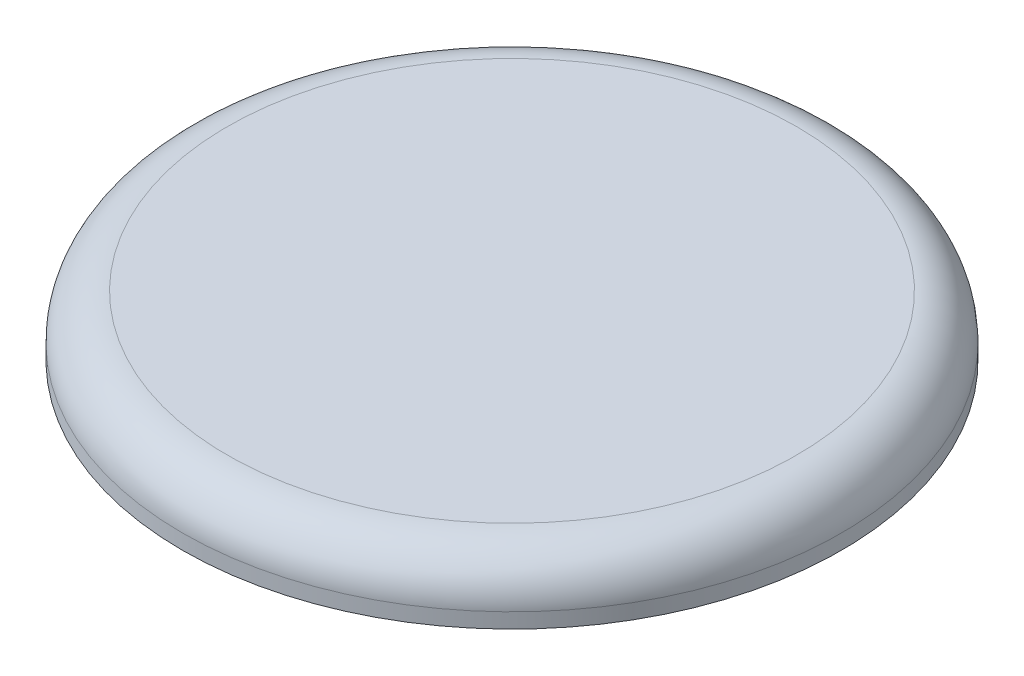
ISO-10303-21;
HEADER;
FILE_DESCRIPTION(('STEP AP214'),'2;1');
FILE_NAME('part.step','',(''),(''),'','','');
FILE_SCHEMA(('AUTOMOTIVE_DESIGN { 1 0 10303 214 1 1 1 1 }'));
ENDSEC;
DATA;
#1=APPLICATION_CONTEXT('core data for automotive mechanical design processes');
#2=APPLICATION_PROTOCOL_DEFINITION('international standard','automotive_design',2000,#1);
#3=PRODUCT_CONTEXT('',#1,'mechanical');
#4=PRODUCT('Part','Part','',(#3));
#5=PRODUCT_RELATED_PRODUCT_CATEGORY('part','',(#4));
#6=PRODUCT_DEFINITION_FORMATION('','',#4);
#7=PRODUCT_DEFINITION_CONTEXT('part definition',#1,'design');
#8=PRODUCT_DEFINITION('design','',#6,#7);
#9=PRODUCT_DEFINITION_SHAPE('','',#8);
#10=(LENGTH_UNIT() NAMED_UNIT(*) SI_UNIT(.MILLI.,.METRE.));
#11=(NAMED_UNIT(*) PLANE_ANGLE_UNIT() SI_UNIT($,.RADIAN.));
#12=(NAMED_UNIT(*) SI_UNIT($,.STERADIAN.) SOLID_ANGLE_UNIT());
#13=UNCERTAINTY_MEASURE_WITH_UNIT(LENGTH_MEASURE(1.E-05),#10,'distance_accuracy_value','');
#14=(GEOMETRIC_REPRESENTATION_CONTEXT(3) GLOBAL_UNCERTAINTY_ASSIGNED_CONTEXT((#13)) GLOBAL_UNIT_ASSIGNED_CONTEXT((#10,
#11,#12)) REPRESENTATION_CONTEXT('',''));
#15=CARTESIAN_POINT('',(0.,0.,0.));
#16=DIRECTION('',(0.,0.,1.));
#17=DIRECTION('',(1.,0.,0.));
#18=AXIS2_PLACEMENT_3D('',#15,#16,#17);
#19=CARTESIAN_POINT('',(0.,5.8,0.));
#20=DIRECTION('',(0.,-1.,0.));
#21=DIRECTION('',(0.,0.,-1.));
#22=AXIS2_PLACEMENT_3D('',#19,#20,#21);
#23=PLANE('',#22);
#24=CARTESIAN_POINT('',(0.,5.8,0.));
#25=DIRECTION('',(0.,-1.,0.));
#26=DIRECTION('',(0.,0.,-1.));
#27=AXIS2_PLACEMENT_3D('',#24,#25,#26);
#28=CIRCLE('',#27,9.5);
#29=CARTESIAN_POINT('',(0.,5.8,-9.5));
#30=VERTEX_POINT('',#29);
#31=EDGE_CURVE('E52',#30,#30,#28,.F.);
#32=ORIENTED_EDGE('',*,*,#31,.T.);
#33=EDGE_LOOP('',(#32));
#34=FACE_BOUND('',#33,.T.);
#35=ADVANCED_FACE('F37',(#34),#23,.F.);
#36=CARTESIAN_POINT('',(0.,28.9361702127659,0.));
#37=DIRECTION('',(0.,1.,0.));
#38=DIRECTION('',(0.,0.,1.));
#39=AXIS2_PLACEMENT_3D('',#36,#37,#38);
#40=CYLINDRICAL_SURFACE('',#39,11.);
#41=CARTESIAN_POINT('',(0.,4.3,0.));
#42=DIRECTION('',(0.,-1.,0.));
#43=DIRECTION('',(0.,0.,-1.));
#44=AXIS2_PLACEMENT_3D('',#41,#42,#43);
#45=CIRCLE('',#44,11.);
#46=CARTESIAN_POINT('',(0.,4.3,-11.));
#47=VERTEX_POINT('',#46);
#48=EDGE_CURVE('E48',#47,#47,#45,.T.);
#49=ORIENTED_EDGE('',*,*,#48,.T.);
#50=EDGE_LOOP('',(#49));
#51=FACE_BOUND('',#50,.T.);
#52=CARTESIAN_POINT('',(0.,3.8,0.));
#53=DIRECTION('',(0.,1.,0.));
#54=DIRECTION('',(0.,0.,1.));
#55=AXIS2_PLACEMENT_3D('',#52,#53,#54);
#56=CIRCLE('',#55,11.);
#57=CARTESIAN_POINT('',(0.,3.8,11.));
#58=VERTEX_POINT('',#57);
#59=EDGE_CURVE('E57',#58,#58,#56,.T.);
#60=ORIENTED_EDGE('',*,*,#59,.T.);
#61=EDGE_LOOP('',(#60));
#62=FACE_BOUND('',#61,.T.);
#63=ADVANCED_FACE('F86',(#51,#62),#40,.T.);
#64=CARTESIAN_POINT('',(11.,3.8,0.));
#65=DIRECTION('',(0.,1.,0.));
#66=DIRECTION('',(0.,0.,1.));
#67=AXIS2_PLACEMENT_3D('',#64,#65,#66);
#68=PLANE('',#67);
#69=ORIENTED_EDGE('',*,*,#59,.F.);
#70=EDGE_LOOP('',(#69));
#71=FACE_BOUND('',#70,.T.);
#72=CARTESIAN_POINT('',(0.,3.8,0.));
#73=DIRECTION('',(0.,1.,0.));
#74=DIRECTION('',(0.,0.,1.));
#75=AXIS2_PLACEMENT_3D('',#72,#73,#74);
#76=CIRCLE('',#75,5.5);
#77=CARTESIAN_POINT('',(0.,3.8,5.5));
#78=VERTEX_POINT('',#77);
#79=EDGE_CURVE('E60',#78,#78,#76,.T.);
#80=ORIENTED_EDGE('',*,*,#79,.T.);
#81=EDGE_LOOP('',(#80));
#82=FACE_BOUND('',#81,.T.);
#83=ADVANCED_FACE('F92',(#71,#82),#68,.F.);
#84=CARTESIAN_POINT('',(0.,28.9361702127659,0.));
#85=DIRECTION('',(0.,1.,0.));
#86=DIRECTION('',(0.,0.,1.));
#87=AXIS2_PLACEMENT_3D('',#84,#85,#86);
#88=CYLINDRICAL_SURFACE('',#87,5.5);
#89=ORIENTED_EDGE('',*,*,#79,.F.);
#90=EDGE_LOOP('',(#89));
#91=FACE_BOUND('',#90,.T.);
#92=CARTESIAN_POINT('',(0.,3.2,0.));
#93=DIRECTION('',(0.,1.,0.));
#94=DIRECTION('',(0.,0.,1.));
#95=AXIS2_PLACEMENT_3D('',#92,#93,#94);
#96=CIRCLE('',#95,5.5);
#97=CARTESIAN_POINT('',(0.,3.2,5.5));
#98=VERTEX_POINT('',#97);
#99=EDGE_CURVE('E63',#98,#98,#96,.T.);
#100=ORIENTED_EDGE('',*,*,#99,.T.);
#101=EDGE_LOOP('',(#100));
#102=FACE_BOUND('',#101,.T.);
#103=ADVANCED_FACE('F82',(#91,#102),#88,.T.);
#104=CARTESIAN_POINT('',(5.5,3.2,0.));
#105=DIRECTION('',(0.,1.,0.));
#106=DIRECTION('',(0.,0.,1.));
#107=AXIS2_PLACEMENT_3D('',#104,#105,#106);
#108=PLANE('',#107);
#109=ORIENTED_EDGE('',*,*,#99,.F.);
#110=EDGE_LOOP('',(#109));
#111=FACE_BOUND('',#110,.T.);
#112=CARTESIAN_POINT('',(0.,3.2,0.));
#113=DIRECTION('',(0.,1.,0.));
#114=DIRECTION('',(0.,0.,1.));
#115=AXIS2_PLACEMENT_3D('',#112,#113,#114);
#116=CIRCLE('',#115,4.);
#117=CARTESIAN_POINT('',(0.,3.2,4.));
#118=VERTEX_POINT('',#117);
#119=EDGE_CURVE('E66',#118,#118,#116,.T.);
#120=ORIENTED_EDGE('',*,*,#119,.T.);
#121=EDGE_LOOP('',(#120));
#122=FACE_BOUND('',#121,.T.);
#123=ADVANCED_FACE('F70',(#111,#122),#108,.F.);
#124=CARTESIAN_POINT('',(0.,28.9361702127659,0.));
#125=DIRECTION('',(0.,1.,0.));
#126=DIRECTION('',(0.,0.,1.));
#127=AXIS2_PLACEMENT_3D('',#124,#125,#126);
#128=CYLINDRICAL_SURFACE('',#127,4.);
#129=CARTESIAN_POINT('',(0.,0.5,0.));
#130=DIRECTION('',(0.,1.,0.));
#131=DIRECTION('',(0.,0.,1.));
#132=AXIS2_PLACEMENT_3D('',#129,#130,#131);
#133=CIRCLE('',#132,4.);
#134=CARTESIAN_POINT('',(0.,0.5,4.));
#135=VERTEX_POINT('',#134);
#136=EDGE_CURVE('E44',#135,#135,#133,.T.);
#137=ORIENTED_EDGE('',*,*,#136,.T.);
#138=EDGE_LOOP('',(#137));
#139=FACE_BOUND('',#138,.T.);
#140=ORIENTED_EDGE('',*,*,#119,.F.);
#141=EDGE_LOOP('',(#140));
#142=FACE_BOUND('',#141,.T.);
#143=ADVANCED_FACE('F72',(#139,#142),#128,.T.);
#144=CARTESIAN_POINT('',(4.,0.,0.));
#145=DIRECTION('',(0.,1.,0.));
#146=DIRECTION('',(0.,0.,1.));
#147=AXIS2_PLACEMENT_3D('',#144,#145,#146);
#148=PLANE('',#147);
#149=CARTESIAN_POINT('',(0.,0.,0.));
#150=DIRECTION('',(0.,1.,0.));
#151=DIRECTION('',(0.,0.,1.));
#152=AXIS2_PLACEMENT_3D('',#149,#150,#151);
#153=CIRCLE('',#152,3.5);
#154=CARTESIAN_POINT('',(0.,0.,3.5));
#155=VERTEX_POINT('',#154);
#156=EDGE_CURVE('E10',#155,#155,#153,.F.);
#157=ORIENTED_EDGE('',*,*,#156,.T.);
#158=EDGE_LOOP('',(#157));
#159=FACE_BOUND('',#158,.T.);
#160=ADVANCED_FACE('F74',(#159),#148,.F.);
#161=CARTESIAN_POINT('',(0.,4.3,0.));
#162=DIRECTION('',(0.,-1.,0.));
#163=DIRECTION('',(0.,0.,-1.));
#164=AXIS2_PLACEMENT_3D('',#161,#162,#163);
#165=TOROIDAL_SURFACE('',#164,9.5,1.5);
#166=ORIENTED_EDGE('',*,*,#48,.F.);
#167=EDGE_LOOP('',(#166));
#168=FACE_BOUND('',#167,.T.);
#169=ORIENTED_EDGE('',*,*,#31,.F.);
#170=EDGE_LOOP('',(#169));
#171=FACE_BOUND('',#170,.T.);
#172=ADVANCED_FACE('F80',(#168,#171),#165,.T.);
#173=CARTESIAN_POINT('',(0.,0.5,0.));
#174=DIRECTION('',(0.,1.,0.));
#175=DIRECTION('',(0.,0.,1.));
#176=AXIS2_PLACEMENT_3D('',#173,#174,#175);
#177=TOROIDAL_SURFACE('',#176,3.5,0.5);
#178=ORIENTED_EDGE('',*,*,#156,.F.);
#179=EDGE_LOOP('',(#178));
#180=FACE_BOUND('',#179,.T.);
#181=ORIENTED_EDGE('',*,*,#136,.F.);
#182=EDGE_LOOP('',(#181));
#183=FACE_BOUND('',#182,.T.);
#184=ADVANCED_FACE('F39',(#180,#183),#177,.T.);
#185=CLOSED_SHELL('',(#35,#63,#83,#103,#123,#143,#160,#172,#184));
#186=MANIFOLD_SOLID_BREP('B2',#185);
#187=ADVANCED_BREP_SHAPE_REPRESENTATION('',(#18,#186),#14);
#188=SHAPE_DEFINITION_REPRESENTATION(#9,#187);
ENDSEC;
END-ISO-10303-21;
